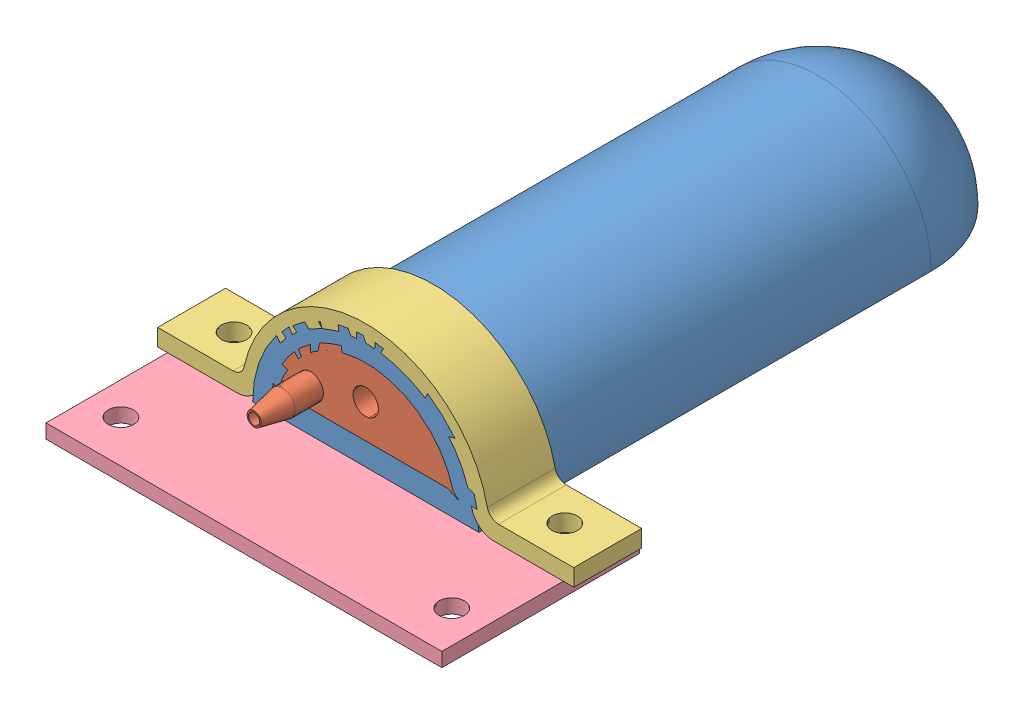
SolidWorks assembly finger_assy.SLDASM, configuration Default (file format 12000). Lengths in mm.
Overall size (73.59 24.5 121.5).
4 component instances, 4 part files, 9 mates.
Components (placement in the parent):
- finger-1: finger.SLDPRT [Default] at (-16.1399 -15.2175 -30.4385) size (40 20 100)
- finger_adapter-1: finger_adapter.SLDPRT [Default] at (-16.1399 -15.2175 69.5615) x (0 0 -1) z (1 0 0) size (25.06 14 33.58)
- clamp-2: clamp.SLDPRT [Default] at (-16.1399 -15.2175 69.5615) x (0 0 -1) z (1 0 0) size (12 22 73.59)
- clamp_connector-1: clamp_connector.SLDPRT [Default] at (-51.1843 -17.7175 91.0615) size (70 2.5 35)
Mates (geometry in assembly coordinates):
- Coincident1: coincident aligned: plane of finger-1 through (-16.1399 -15.2175 69.5615) normal (0 0 1); plane of finger_adapter-1 through (-16.1399 -15.2175 69.5615) normal (0 0 1)
- Concentric1: concentric anti-aligned: cylinder of finger-1 through (-16.1399 -15.2175 69.5615) axis (0 0 -1) radius 16; cylinder of finger_adapter-1 through (-16.1399 -15.2175 54.5615) axis (0 0 1) radius 17
- Parallel1: parallel anti-aligned: plane of finger-1 through (-36.1399 -11.2175 69.5615) normal (0 1 0); plane of finger_adapter-1 through (0.5933 -12.2175 54.5615) normal (0 -1 0)
- Coincident3: coincident aligned: plane of finger-1 through (-16.1399 -15.2175 69.5615) normal (0 0 1); plane of clamp-2 through (-16.1399 -15.2175 69.5615) normal (0 0 1)
- Concentric2: concentric anti-aligned: cylinder of finger-1 through (-16.1399 -15.2175 69.5615) axis (0 0 -1) radius 20; cylinder of clamp-2 through (-16.1399 -15.2175 57.5615) axis (0 0 1) radius 19
- Coincident4: coincident aligned: plane of finger-1 through (-36.1399 -15.2175 69.5615) normal (0 -1 0); plane of clamp-2 through (2.8601 -15.2175 57.5615) normal (0 -1 0)
- Concentric3: concentric aligned: cylinder of clamp-2 through (13.0657 -15.2175 63.5615) axis (0 1 0) radius 2.25; cylinder of clamp_connector-1 through (13.0657 -17.7175 63.5615) axis (0 1 0) radius 2.25
- Concentric4: concentric aligned: cylinder of clamp-2 through (-45.4343 -15.2175 63.5615) axis (0 1 0) radius 2.25; cylinder of clamp_connector-1 through (-45.4343 -17.7175 63.5615) axis (0 1 0) radius 2.25
- Coincident5: coincident anti-aligned: plane of clamp-2 through (-35.1399 -15.2175 57.5615) normal (0 -1 0); plane of clamp_connector-1 through (-51.1843 -15.2175 91.0615) normal (0 1 0)
